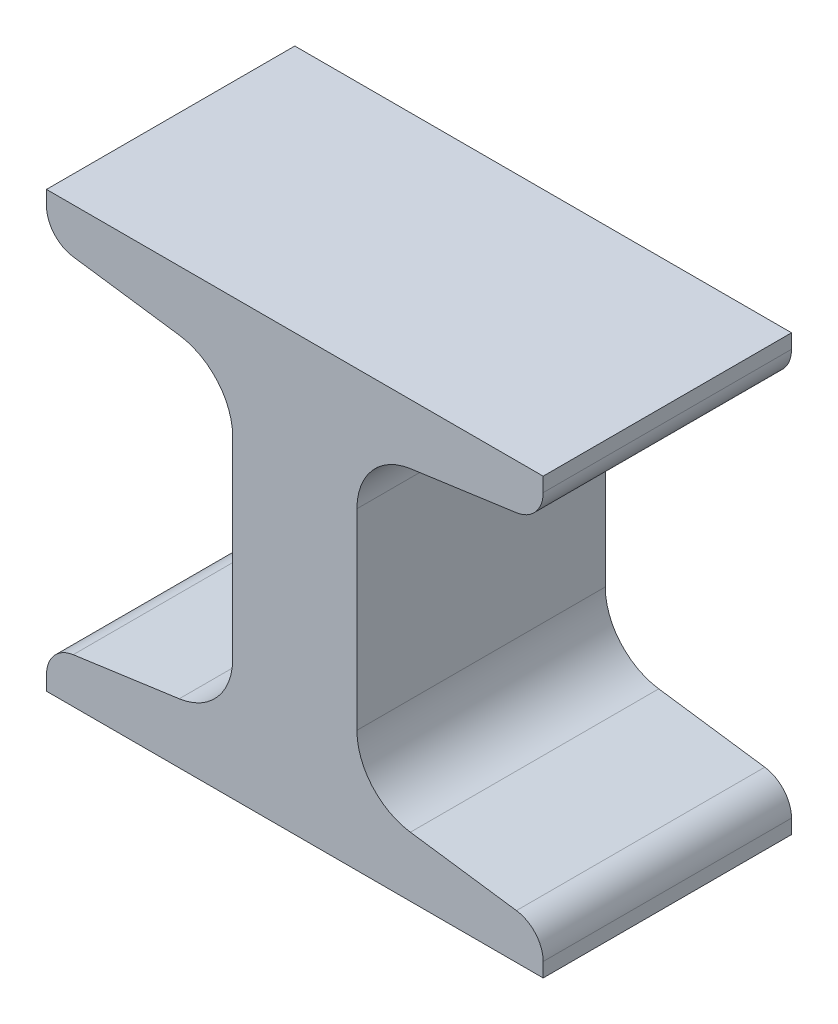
from build123d import *

# Parameters (mm, degrees)
BASESBEAM_DEPTH = 12.7
TOEFILLET_R     = 3.175


with BuildPart() as part:
    # Sketch1 → BaseSbeam (new, symmetric)
    with BuildSketch(Plane.XY):
        with BuildLine():
            Line((0, 0), (0, 4.22213795))
            Line((0, 4.22213795), (13.580346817, 6.123238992))
            ThreePointArc((13.580346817, 6.123238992), (17.491278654, 8.24464731), (19.05, 12.411918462))
            Line((19.05, 12.411918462), (19.05, 32.038081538))
            ThreePointArc((19.05, 32.038081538), (17.491278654, 36.20535269), (13.580346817, 38.326761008))
            Line((13.580346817, 38.326761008), (0, 40.22786205))
            Line((0, 40.22786205), (0, 44.45))
            Line((0, 44.45), (50.8, 44.45))
            Line((50.8, 44.45), (50.8, 40.22786205))
            Line((50.8, 40.22786205), (37.219653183, 38.326761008))
            ThreePointArc((37.219653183, 38.326761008), (33.308721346, 36.20535269), (31.75, 32.038081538))
            Line((31.75, 32.038081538), (31.75, 12.411918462))
            ThreePointArc((31.75, 12.411918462), (33.308721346, 8.24464731), (37.219653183, 6.123238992))
            Line((37.219653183, 6.123238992), (50.8, 4.22213795))
            Line((50.8, 4.22213795), (50.8, 0))
            Line((50.8, 0), (0, 0))
        make_face()
    extrude(amount=BASESBEAM_DEPTH, both=True)

    # ToeFillet
    toefillet_edges = [part.edges().sort_by_distance(p)[0] for p in [
        (50.8, 4.22213795, 0),
        (50.8, 40.22786205, 0),
        (0, 40.22786205, 0),
        (0, 4.22213795, 0),
    ]]
    fillet(toefillet_edges, radius=TOEFILLET_R)


solid = part.part
